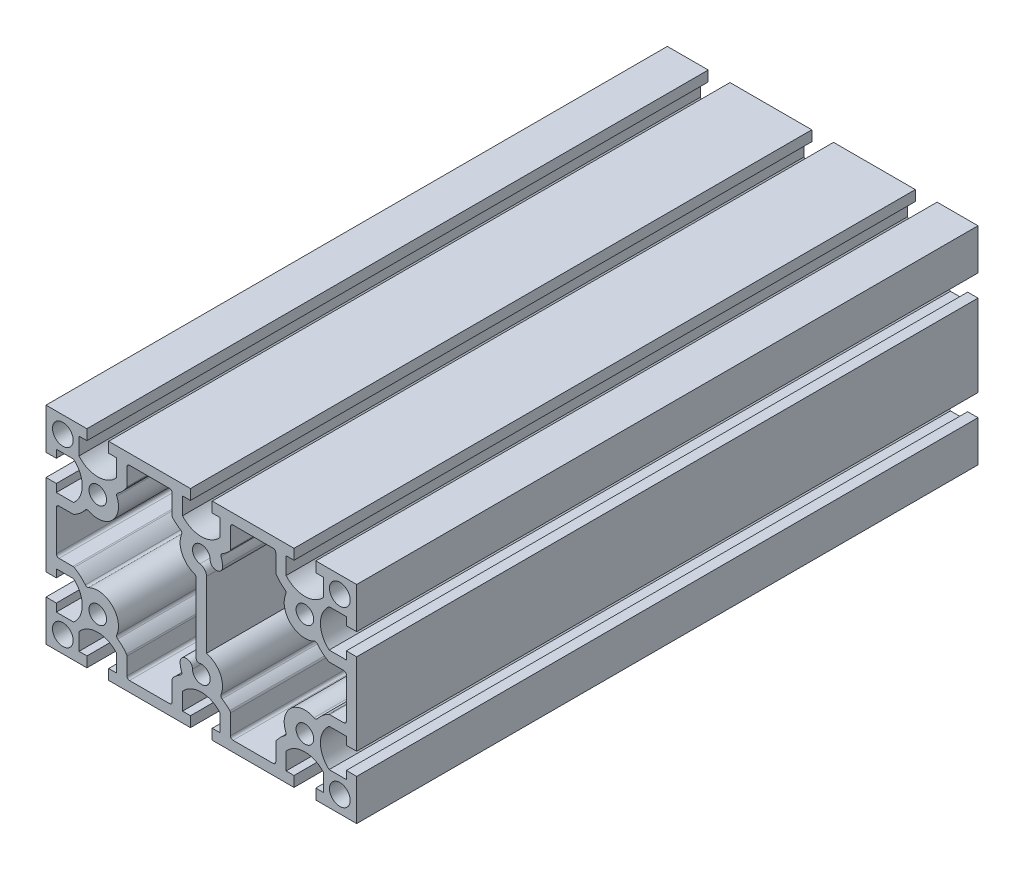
from build123d import *

# Parameters (mm, degrees)
EXTRUDE_1_DEPTH                 = 120
CUT_EXTRUDE_1_REACH             = 142
SKETCH_2_R                      = 4
SKETCH_2_R_2                    = 3.4
CUT_EXTRUDE_1_DIRECTION_2_REACH = 142
CUT_EXTRUDE_2_REACH             = 142
CUT_EXTRUDE_2_DIRECTION_2_REACH = 142


with BuildPart() as part:
    # Sketch 1 → Extrude 1 (new, symmetric)
    with BuildSketch(Plane.XY):
        with BuildLine():
            Line((4.2, 40), (35.8, 40))
            Line((35.8, 40), (35.8, 36))
            Line((35.8, 36), (32.75, 36))
            Line((32.75, 36), (32.75, 29.360985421))
            ThreePointArc((32.75, 29.360985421), (40, 26), (47.25, 29.360985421))
            Line((47.25, 29.360985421), (47.25, 36))
            Line((47.25, 36), (44.2, 36))
            Line((44.2, 36), (44.2, 40))
            Line((44.2, 40), (60, 40))
            Line((60, 40), (60, 24.2))
            Line((60, 24.2), (56, 24.2))
            Line((56, 24.2), (56, 27.25))
            Line((56, 27.25), (49.360985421, 27.25))
            ThreePointArc((49.360985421, 27.25), (46, 20), (49.360985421, 12.75))
            Line((49.360985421, 12.75), (56, 12.75))
            Line((56, 12.75), (56, 15.8))
            Line((56, 15.8), (60, 15.8))
            Line((60, 15.8), (60, -15.8))
            Line((60, -15.8), (56, -15.8))
            Line((56, -15.8), (56, -12.75))
            Line((56, -12.75), (49.360985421, -12.75))
            ThreePointArc((49.360985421, -12.75), (46, -20), (49.360985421, -27.25))
            Line((49.360985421, -27.25), (56, -27.25))
            Line((56, -27.25), (56, -24.2))
            Line((56, -24.2), (60, -24.2))
            Line((60, -24.2), (60, -40))
            Line((60, -40), (44.2, -40))
            Line((44.2, -40), (44.2, -36))
            Line((44.2, -36), (47.25, -36))
            Line((47.25, -36), (47.25, -29.360985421))
            ThreePointArc((47.25, -29.360985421), (40, -26), (32.75, -29.360985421))
            Line((32.75, -29.360985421), (32.75, -36))
            Line((32.75, -36), (35.8, -36))
            Line((35.8, -36), (35.8, -40))
            Line((35.8, -40), (4.2, -40))
            Line((4.2, -40), (4.2, -36))
            Line((4.2, -36), (7.25, -36))
            Line((7.25, -36), (7.25, -29.360985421))
            ThreePointArc((7.25, -29.360985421), (0, -26), (-7.25, -29.360985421))
            Line((-7.25, -29.360985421), (-7.25, -36))
            Line((-7.25, -36), (-4.2, -36))
            Line((-4.2, -36), (-4.2, -40))
            Line((-4.2, -40), (-35.8, -40))
            Line((-35.8, -40), (-35.8, -36))
            Line((-35.8, -36), (-32.75, -36))
            Line((-32.75, -36), (-32.75, -29.360985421))
            ThreePointArc((-32.75, -29.360985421), (-40, -26), (-47.25, -29.360985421))
            Line((-47.25, -29.360985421), (-47.25, -36))
            Line((-47.25, -36), (-44.2, -36))
            Line((-44.2, -36), (-44.2, -40))
            Line((-44.2, -40), (-60, -40))
            Line((-60, -40), (-60, -24.2))
            Line((-60, -24.2), (-56, -24.2))
            Line((-56, -24.2), (-56, -27.25))
            Line((-56, -27.25), (-49.360985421, -27.25))
            ThreePointArc((-49.360985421, -27.25), (-46, -20), (-49.360985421, -12.75))
            Line((-49.360985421, -12.75), (-56, -12.75))
            Line((-56, -12.75), (-56, -15.8))
            Line((-56, -15.8), (-60, -15.8))
            Line((-60, -15.8), (-60, 15.8))
            Line((-60, 15.8), (-56, 15.8))
            Line((-56, 15.8), (-56, 12.75))
            Line((-56, 12.75), (-49.360985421, 12.75))
            ThreePointArc((-49.360985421, 12.75), (-46, 20), (-49.360985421, 27.25))
            Line((-49.360985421, 27.25), (-56, 27.25))
            Line((-56, 27.25), (-56, 24.2))
            Line((-56, 24.2), (-60, 24.2))
            Line((-60, 24.2), (-60, 40))
            Line((-60, 40), (-44.2, 40))
            Line((-44.2, 40), (-44.2, 36))
            Line((-44.2, 36), (-47.25, 36))
            Line((-47.25, 36), (-47.25, 29.360985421))
            ThreePointArc((-47.25, 29.360985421), (-40, 26), (-32.75, 29.360985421))
            Line((-32.75, 29.360985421), (-32.75, 36))
            Line((-32.75, 36), (-35.8, 36))
            Line((-35.8, 36), (-35.8, 40))
            Line((-35.8, 40), (-4.2, 40))
            Line((-4.2, 40), (-4.2, 36))
            Line((-4.2, 36), (-7.25, 36))
            Line((-7.25, 36), (-7.25, 29.360985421))
            ThreePointArc((-7.25, 29.360985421), (0, 26), (7.25, 29.360985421))
            Line((7.25, 29.360985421), (7.25, 36))
            Line((7.25, 36), (4.2, 36))
            Line((4.2, 36), (4.2, 40))
        make_face()
    extrude(amount=EXTRUDE_1_DEPTH, both=True)

    # Sketch 2 → Cut-Extrude 1 (cut, up to next)
    with BuildSketch(Plane.XY, mode=Mode.PRIVATE) as cut_extrude_1_sk1:
        with Locations((53.5, 33.5)):
            Circle(SKETCH_2_R)
    cut_extrude_1_tool1 = extrude(cut_extrude_1_sk1.sketch, amount=-CUT_EXTRUDE_1_REACH, mode=Mode.PRIVATE) & part.part
    # Sketch 2 → Cut-Extrude 1 (cut, up to next)
    with BuildSketch(Plane.XY, mode=Mode.PRIVATE) as cut_extrude_1_sk2:
        with Locations((-53.5, 33.5)):
            Circle(SKETCH_2_R)
    cut_extrude_1_tool2 = extrude(cut_extrude_1_sk2.sketch, amount=-CUT_EXTRUDE_1_REACH, mode=Mode.PRIVATE) & part.part
    # Sketch 2 → Cut-Extrude 1 (cut, up to next)
    with BuildSketch(Plane.XY, mode=Mode.PRIVATE) as cut_extrude_1_sk3:
        with Locations((53.5, -33.5)):
            Circle(SKETCH_2_R)
    cut_extrude_1_tool3 = extrude(cut_extrude_1_sk3.sketch, amount=-CUT_EXTRUDE_1_REACH, mode=Mode.PRIVATE) & part.part
    # Sketch 2 → Cut-Extrude 1 (cut, up to next)
    with BuildSketch(Plane.XY, mode=Mode.PRIVATE) as cut_extrude_1_sk4:
        with Locations((-53.5, -33.5)):
            Circle(SKETCH_2_R)
    cut_extrude_1_tool4 = extrude(cut_extrude_1_sk4.sketch, amount=-CUT_EXTRUDE_1_REACH, mode=Mode.PRIVATE) & part.part
    # Sketch 2 → Cut-Extrude 1 (cut, up to next)
    with BuildSketch(Plane.XY, mode=Mode.PRIVATE) as cut_extrude_1_sk5:
        with Locations((40, 20)):
            Circle(SKETCH_2_R_2)
    cut_extrude_1_tool5 = extrude(cut_extrude_1_sk5.sketch, amount=-CUT_EXTRUDE_1_REACH, mode=Mode.PRIVATE) & part.part
    # Sketch 2 → Cut-Extrude 1 (cut, up to next)
    with BuildSketch(Plane.XY, mode=Mode.PRIVATE) as cut_extrude_1_sk6:
        with Locations((-40, 20)):
            Circle(SKETCH_2_R_2)
    cut_extrude_1_tool6 = extrude(cut_extrude_1_sk6.sketch, amount=-CUT_EXTRUDE_1_REACH, mode=Mode.PRIVATE) & part.part
    # Sketch 2 → Cut-Extrude 1 (cut, up to next)
    with BuildSketch(Plane.XY, mode=Mode.PRIVATE) as cut_extrude_1_sk7:
        with Locations((-40, -20)):
            Circle(SKETCH_2_R_2)
    cut_extrude_1_tool7 = extrude(cut_extrude_1_sk7.sketch, amount=-CUT_EXTRUDE_1_REACH, mode=Mode.PRIVATE) & part.part
    # Sketch 2 → Cut-Extrude 1 (cut, up to next)
    with BuildSketch(Plane.XY, mode=Mode.PRIVATE) as cut_extrude_1_sk8:
        with Locations((40, -20)):
            Circle(SKETCH_2_R_2)
    cut_extrude_1_tool8 = extrude(cut_extrude_1_sk8.sketch, amount=-CUT_EXTRUDE_1_REACH, mode=Mode.PRIVATE) & part.part
    # Sketch 2 → Cut-Extrude 1 (cut, up to next)
    with BuildSketch(Plane.XY, mode=Mode.PRIVATE) as cut_extrude_1_sk9:
        with Locations((0, 20)):
            Circle(SKETCH_2_R_2)
    cut_extrude_1_tool9 = extrude(cut_extrude_1_sk9.sketch, amount=-CUT_EXTRUDE_1_REACH, mode=Mode.PRIVATE) & part.part
    # Sketch 2 → Cut-Extrude 1 (cut, up to next)
    with BuildSketch(Plane.XY, mode=Mode.PRIVATE) as cut_extrude_1_sk10:
        with Locations((0, -20)):
            Circle(SKETCH_2_R_2)
    cut_extrude_1_tool10 = extrude(cut_extrude_1_sk10.sketch, amount=-CUT_EXTRUDE_1_REACH, mode=Mode.PRIVATE) & part.part
    add(cut_extrude_1_tool1.solids().sort_by_distance((53.5, 33.5, 0))[0], mode=Mode.SUBTRACT)
    add(cut_extrude_1_tool2.solids().sort_by_distance((-53.5, 33.5, 0))[0], mode=Mode.SUBTRACT)
    add(cut_extrude_1_tool3.solids().sort_by_distance((53.5, -33.5, 0))[0], mode=Mode.SUBTRACT)
    add(cut_extrude_1_tool4.solids().sort_by_distance((-53.5, -33.5, 0))[0], mode=Mode.SUBTRACT)
    add(cut_extrude_1_tool5.solids().sort_by_distance((40, 20, 0))[0], mode=Mode.SUBTRACT)
    add(cut_extrude_1_tool6.solids().sort_by_distance((-40, 20, 0))[0], mode=Mode.SUBTRACT)
    add(cut_extrude_1_tool7.solids().sort_by_distance((-40, -20, 0))[0], mode=Mode.SUBTRACT)
    add(cut_extrude_1_tool8.solids().sort_by_distance((40, -20, 0))[0], mode=Mode.SUBTRACT)
    add(cut_extrude_1_tool9.solids().sort_by_distance((0, 20, 0))[0], mode=Mode.SUBTRACT)
    add(cut_extrude_1_tool10.solids().sort_by_distance((0, -20, 0))[0], mode=Mode.SUBTRACT)

    # Sketch 2 → Cut-Extrude 1 direction 2 (cut, up to next)
    with BuildSketch(Plane.XY, mode=Mode.PRIVATE) as cut_extrude_1_direction_2_sk1:
        with Locations((53.5, 33.5)):
            Circle(SKETCH_2_R)
    cut_extrude_1_direction_2_tool1 = extrude(cut_extrude_1_direction_2_sk1.sketch, amount=CUT_EXTRUDE_1_DIRECTION_2_REACH, mode=Mode.PRIVATE) & part.part
    # Sketch 2 → Cut-Extrude 1 direction 2 (cut, up to next)
    with BuildSketch(Plane.XY, mode=Mode.PRIVATE) as cut_extrude_1_direction_2_sk2:
        with Locations((-53.5, 33.5)):
            Circle(SKETCH_2_R)
    cut_extrude_1_direction_2_tool2 = extrude(cut_extrude_1_direction_2_sk2.sketch, amount=CUT_EXTRUDE_1_DIRECTION_2_REACH, mode=Mode.PRIVATE) & part.part
    # Sketch 2 → Cut-Extrude 1 direction 2 (cut, up to next)
    with BuildSketch(Plane.XY, mode=Mode.PRIVATE) as cut_extrude_1_direction_2_sk3:
        with Locations((53.5, -33.5)):
            Circle(SKETCH_2_R)
    cut_extrude_1_direction_2_tool3 = extrude(cut_extrude_1_direction_2_sk3.sketch, amount=CUT_EXTRUDE_1_DIRECTION_2_REACH, mode=Mode.PRIVATE) & part.part
    # Sketch 2 → Cut-Extrude 1 direction 2 (cut, up to next)
    with BuildSketch(Plane.XY, mode=Mode.PRIVATE) as cut_extrude_1_direction_2_sk4:
        with Locations((-53.5, -33.5)):
            Circle(SKETCH_2_R)
    cut_extrude_1_direction_2_tool4 = extrude(cut_extrude_1_direction_2_sk4.sketch, amount=CUT_EXTRUDE_1_DIRECTION_2_REACH, mode=Mode.PRIVATE) & part.part
    # Sketch 2 → Cut-Extrude 1 direction 2 (cut, up to next)
    with BuildSketch(Plane.XY, mode=Mode.PRIVATE) as cut_extrude_1_direction_2_sk5:
        with Locations((40, 20)):
            Circle(SKETCH_2_R_2)
    cut_extrude_1_direction_2_tool5 = extrude(cut_extrude_1_direction_2_sk5.sketch, amount=CUT_EXTRUDE_1_DIRECTION_2_REACH, mode=Mode.PRIVATE) & part.part
    # Sketch 2 → Cut-Extrude 1 direction 2 (cut, up to next)
    with BuildSketch(Plane.XY, mode=Mode.PRIVATE) as cut_extrude_1_direction_2_sk6:
        with Locations((-40, 20)):
            Circle(SKETCH_2_R_2)
    cut_extrude_1_direction_2_tool6 = extrude(cut_extrude_1_direction_2_sk6.sketch, amount=CUT_EXTRUDE_1_DIRECTION_2_REACH, mode=Mode.PRIVATE) & part.part
    # Sketch 2 → Cut-Extrude 1 direction 2 (cut, up to next)
    with BuildSketch(Plane.XY, mode=Mode.PRIVATE) as cut_extrude_1_direction_2_sk7:
        with Locations((-40, -20)):
            Circle(SKETCH_2_R_2)
    cut_extrude_1_direction_2_tool7 = extrude(cut_extrude_1_direction_2_sk7.sketch, amount=CUT_EXTRUDE_1_DIRECTION_2_REACH, mode=Mode.PRIVATE) & part.part
    # Sketch 2 → Cut-Extrude 1 direction 2 (cut, up to next)
    with BuildSketch(Plane.XY, mode=Mode.PRIVATE) as cut_extrude_1_direction_2_sk8:
        with Locations((40, -20)):
            Circle(SKETCH_2_R_2)
    cut_extrude_1_direction_2_tool8 = extrude(cut_extrude_1_direction_2_sk8.sketch, amount=CUT_EXTRUDE_1_DIRECTION_2_REACH, mode=Mode.PRIVATE) & part.part
    # Sketch 2 → Cut-Extrude 1 direction 2 (cut, up to next)
    with BuildSketch(Plane.XY, mode=Mode.PRIVATE) as cut_extrude_1_direction_2_sk9:
        with Locations((0, 20)):
            Circle(SKETCH_2_R_2)
    cut_extrude_1_direction_2_tool9 = extrude(cut_extrude_1_direction_2_sk9.sketch, amount=CUT_EXTRUDE_1_DIRECTION_2_REACH, mode=Mode.PRIVATE) & part.part
    # Sketch 2 → Cut-Extrude 1 direction 2 (cut, up to next)
    with BuildSketch(Plane.XY, mode=Mode.PRIVATE) as cut_extrude_1_direction_2_sk10:
        with Locations((0, -20)):
            Circle(SKETCH_2_R_2)
    cut_extrude_1_direction_2_tool10 = extrude(cut_extrude_1_direction_2_sk10.sketch, amount=CUT_EXTRUDE_1_DIRECTION_2_REACH, mode=Mode.PRIVATE) & part.part
    add(cut_extrude_1_direction_2_tool1.solids().sort_by_distance((53.5, 33.5, 0))[0], mode=Mode.SUBTRACT)
    add(cut_extrude_1_direction_2_tool2.solids().sort_by_distance((-53.5, 33.5, 0))[0], mode=Mode.SUBTRACT)
    add(cut_extrude_1_direction_2_tool3.solids().sort_by_distance((53.5, -33.5, 0))[0], mode=Mode.SUBTRACT)
    add(cut_extrude_1_direction_2_tool4.solids().sort_by_distance((-53.5, -33.5, 0))[0], mode=Mode.SUBTRACT)
    add(cut_extrude_1_direction_2_tool5.solids().sort_by_distance((40, 20, 0))[0], mode=Mode.SUBTRACT)
    add(cut_extrude_1_direction_2_tool6.solids().sort_by_distance((-40, 20, 0))[0], mode=Mode.SUBTRACT)
    add(cut_extrude_1_direction_2_tool7.solids().sort_by_distance((-40, -20, 0))[0], mode=Mode.SUBTRACT)
    add(cut_extrude_1_direction_2_tool8.solids().sort_by_distance((40, -20, 0))[0], mode=Mode.SUBTRACT)
    add(cut_extrude_1_direction_2_tool9.solids().sort_by_distance((0, 20, 0))[0], mode=Mode.SUBTRACT)
    add(cut_extrude_1_direction_2_tool10.solids().sort_by_distance((0, -20, 0))[0], mode=Mode.SUBTRACT)

    # Sketch 3 → Cut-Extrude 2 (cut, up to next)
    with BuildSketch(Plane.XY, mode=Mode.PRIVATE) as cut_extrude_2_sk1:
        with BuildLine():
            Line((2, -12.047641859), (2, 13.678607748))
            ThreePointArc((2, 13.678607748), (1.281035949, 15.627164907), (-0.53125, 16.641760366))
            ThreePointArc((-0.53125, 16.641760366), (-2.20836478, 22.585174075), (3.4, 20))
            ThreePointArc((3.4, 20), (5.8, 17.6), (8.2, 20))
            ThreePointArc((8.2, 20), (8.05080508, 21.557092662), (7.608649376, 23.057524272))
            ThreePointArc((7.608649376, 23.057524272), (7.588720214, 23.749219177), (8.022641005, 24.288247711))
            ThreePointArc((8.022641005, 24.288247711), (9.58807252, 25.383612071), (10.983192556, 26.689000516))
            ThreePointArc((10.983192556, 26.689000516), (11.180911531, 27.003776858), (11.25, 27.369021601))
            Line((11.25, 27.369021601), (11.25, 35))
            ThreePointArc((11.25, 35), (11.542893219, 35.707106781), (12.25, 36))
            Line((12.25, 36), (27.75, 36))
            ThreePointArc((27.75, 36), (28.457106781, 35.707106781), (28.75, 35))
            Line((28.75, 35), (28.75, 28.345455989))
            ThreePointArc((28.75, 28.345455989), (28.796060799, 28.045455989), (28.93, 27.773092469))
            ThreePointArc((28.93, 27.773092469), (30.470998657, 25.93714826), (32.312395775, 24.402669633))
            ThreePointArc((32.312395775, 24.402669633), (32.70457927, 23.854974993), (32.66039432, 23.182795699))
            ThreePointArc((32.66039432, 23.182795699), (34.491304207, 14.198769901), (43.557967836, 12.834746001))
            ThreePointArc((43.557967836, 12.834746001), (44.228105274, 12.913357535), (44.795630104, 12.548419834))
            ThreePointArc((44.795630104, 12.548419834), (46.770106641, 10.476860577), (49.136885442, 8.868049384))
            ThreePointArc((49.136885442, 8.868049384), (49.365277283, 8.779961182), (49.608227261, 8.75))
            Line((49.608227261, 8.75), (55, 8.75))
            ThreePointArc((55, 8.75), (55.707106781, 8.457106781), (56, 7.75))
            Line((56, 7.75), (56, -7.75))
            ThreePointArc((56, -7.75), (55.707106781, -8.457106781), (55, -8.75))
            Line((55, -8.75), (49.608227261, -8.75))
            ThreePointArc((49.608227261, -8.75), (49.365277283, -8.779961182), (49.136885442, -8.868049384))
            ThreePointArc((49.136885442, -8.868049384), (46.770106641, -10.476860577), (44.795630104, -12.548419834))
            ThreePointArc((44.795630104, -12.548419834), (44.228105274, -12.913357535), (43.557967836, -12.834746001))
            ThreePointArc((43.557967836, -12.834746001), (34.491304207, -14.198769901), (32.66039432, -23.182795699))
            ThreePointArc((32.66039432, -23.182795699), (32.70457927, -23.854974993), (32.312395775, -24.402669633))
            ThreePointArc((32.312395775, -24.402669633), (30.470998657, -25.93714826), (28.93, -27.773092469))
            ThreePointArc((28.93, -27.773092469), (28.796060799, -28.045455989), (28.75, -28.345455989))
            Line((28.75, -28.345455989), (28.75, -35))
            ThreePointArc((28.75, -35), (28.457106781, -35.707106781), (27.75, -36))
            Line((27.75, -36), (12.25, -36))
            ThreePointArc((12.25, -36), (11.542893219, -35.707106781), (11.25, -35))
            Line((11.25, -35), (11.25, -27.369021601))
            ThreePointArc((11.25, -27.369021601), (11.180911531, -27.003776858), (10.983192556, -26.689000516))
            ThreePointArc((10.983192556, -26.689000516), (9.58807252, -25.383612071), (8.022641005, -24.288247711))
            ThreePointArc((8.022641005, -24.288247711), (7.588720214, -23.749219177), (7.608649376, -23.057524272))
            ThreePointArc((7.608649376, -23.057524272), (7.306566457, -16.277892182), (2, -12.047641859))
        make_face()
    cut_extrude_2_tool1 = extrude(cut_extrude_2_sk1.sketch, amount=-CUT_EXTRUDE_2_REACH, mode=Mode.PRIVATE) & part.part
    # Sketch 3 → Cut-Extrude 2 (cut, up to next)
    with BuildSketch(Plane.XY, mode=Mode.PRIVATE) as cut_extrude_2_sk2:
        with BuildLine():
            Line((-2, -15.715142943), (-2, 11.302874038))
            ThreePointArc((-2, 11.302874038), (-2.185725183, 11.8833536), (-2.673913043, 12.248213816))
            ThreePointArc((-2.673913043, 12.248213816), (-7.459428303, 16.594573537), (-7.608649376, 23.057524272))
            ThreePointArc((-7.608649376, 23.057524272), (-7.588720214, 23.749219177), (-8.022641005, 24.288247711))
            ThreePointArc((-8.022641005, 24.288247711), (-9.58807252, 25.383612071), (-10.983192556, 26.689000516))
            ThreePointArc((-10.983192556, 26.689000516), (-11.180911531, 27.003776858), (-11.25, 27.369021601))
            Line((-11.25, 27.369021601), (-11.25, 35))
            ThreePointArc((-11.25, 35), (-11.542893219, 35.707106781), (-12.25, 36))
            Line((-12.25, 36), (-27.75, 36))
            ThreePointArc((-27.75, 36), (-28.457106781, 35.707106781), (-28.75, 35))
            Line((-28.75, 35), (-28.75, 28.345455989))
            ThreePointArc((-28.75, 28.345455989), (-28.796060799, 28.045455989), (-28.93, 27.773092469))
            ThreePointArc((-28.93, 27.773092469), (-30.470998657, 25.93714826), (-32.312395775, 24.402669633))
            ThreePointArc((-32.312395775, 24.402669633), (-32.70457927, 23.854974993), (-32.66039432, 23.182795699))
            ThreePointArc((-32.66039432, 23.182795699), (-34.491304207, 14.198769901), (-43.557967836, 12.834746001))
            ThreePointArc((-43.557967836, 12.834746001), (-44.228105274, 12.913357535), (-44.795630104, 12.548419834))
            ThreePointArc((-44.795630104, 12.548419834), (-46.770106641, 10.476860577), (-49.136885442, 8.868049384))
            ThreePointArc((-49.136885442, 8.868049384), (-49.365277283, 8.779961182), (-49.608227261, 8.75))
            Line((-49.608227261, 8.75), (-55, 8.75))
            ThreePointArc((-55, 8.75), (-55.707106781, 8.457106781), (-56, 7.75))
            Line((-56, 7.75), (-56, -7.75))
            ThreePointArc((-56, -7.75), (-55.707106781, -8.457106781), (-55, -8.75))
            Line((-55, -8.75), (-49.608227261, -8.75))
            ThreePointArc((-49.608227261, -8.75), (-49.365277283, -8.779961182), (-49.136885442, -8.868049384))
            ThreePointArc((-49.136885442, -8.868049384), (-46.770106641, -10.476860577), (-44.795630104, -12.548419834))
            ThreePointArc((-44.795630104, -12.548419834), (-44.228105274, -12.913357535), (-43.557967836, -12.834746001))
            ThreePointArc((-43.557967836, -12.834746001), (-34.491304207, -14.198769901), (-32.66039432, -23.182795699))
            ThreePointArc((-32.66039432, -23.182795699), (-32.70457927, -23.854974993), (-32.312395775, -24.402669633))
            ThreePointArc((-32.312395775, -24.402669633), (-30.470998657, -25.93714826), (-28.93, -27.773092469))
            ThreePointArc((-28.93, -27.773092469), (-28.796060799, -28.045455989), (-28.75, -28.345455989))
            Line((-28.75, -28.345455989), (-28.75, -35))
            ThreePointArc((-28.75, -35), (-28.457106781, -35.707106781), (-27.75, -36))
            Line((-27.75, -36), (-12.25, -36))
            ThreePointArc((-12.25, -36), (-11.542893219, -35.707106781), (-11.25, -35))
            Line((-11.25, -35), (-11.25, -27.369021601))
            ThreePointArc((-11.25, -27.369021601), (-11.180911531, -27.003776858), (-10.983192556, -26.689000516))
            ThreePointArc((-10.983192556, -26.689000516), (-9.58807252, -25.383612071), (-8.022641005, -24.288247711))
            ThreePointArc((-8.022641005, -24.288247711), (-7.588720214, -23.749219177), (-7.608649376, -23.057524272))
            ThreePointArc((-7.608649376, -23.057524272), (-8.05080508, -21.557092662), (-8.2, -20))
            ThreePointArc((-8.2, -20), (-5.8, -17.6), (-3.4, -20))
            ThreePointArc((-3.4, -20), (2.663388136, -22.113377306), (-0.772727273, -16.688974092))
            ThreePointArc((-0.772727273, -16.688974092), (-1.621581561, -16.498492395), (-2, -15.715142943))
        make_face()
    cut_extrude_2_tool2 = extrude(cut_extrude_2_sk2.sketch, amount=-CUT_EXTRUDE_2_REACH, mode=Mode.PRIVATE) & part.part
    add(cut_extrude_2_tool1.solids().sort_by_distance((23.741529, 0.484413, 0))[0], mode=Mode.SUBTRACT)
    add(cut_extrude_2_tool2.solids().sort_by_distance((-23.758301, -0.474004, 0))[0], mode=Mode.SUBTRACT)

    # Sketch 3 → Cut-Extrude 2 direction 2 (cut, up to next)
    with BuildSketch(Plane.XY, mode=Mode.PRIVATE) as cut_extrude_2_direction_2_sk1:
        with BuildLine():
            Line((2, -12.047641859), (2, 13.678607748))
            ThreePointArc((2, 13.678607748), (1.281035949, 15.627164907), (-0.53125, 16.641760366))
            ThreePointArc((-0.53125, 16.641760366), (-2.20836478, 22.585174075), (3.4, 20))
            ThreePointArc((3.4, 20), (5.8, 17.6), (8.2, 20))
            ThreePointArc((8.2, 20), (8.05080508, 21.557092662), (7.608649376, 23.057524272))
            ThreePointArc((7.608649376, 23.057524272), (7.588720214, 23.749219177), (8.022641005, 24.288247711))
            ThreePointArc((8.022641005, 24.288247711), (9.58807252, 25.383612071), (10.983192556, 26.689000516))
            ThreePointArc((10.983192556, 26.689000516), (11.180911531, 27.003776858), (11.25, 27.369021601))
            Line((11.25, 27.369021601), (11.25, 35))
            ThreePointArc((11.25, 35), (11.542893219, 35.707106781), (12.25, 36))
            Line((12.25, 36), (27.75, 36))
            ThreePointArc((27.75, 36), (28.457106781, 35.707106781), (28.75, 35))
            Line((28.75, 35), (28.75, 28.345455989))
            ThreePointArc((28.75, 28.345455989), (28.796060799, 28.045455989), (28.93, 27.773092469))
            ThreePointArc((28.93, 27.773092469), (30.470998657, 25.93714826), (32.312395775, 24.402669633))
            ThreePointArc((32.312395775, 24.402669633), (32.70457927, 23.854974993), (32.66039432, 23.182795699))
            ThreePointArc((32.66039432, 23.182795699), (34.491304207, 14.198769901), (43.557967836, 12.834746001))
            ThreePointArc((43.557967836, 12.834746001), (44.228105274, 12.913357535), (44.795630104, 12.548419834))
            ThreePointArc((44.795630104, 12.548419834), (46.770106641, 10.476860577), (49.136885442, 8.868049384))
            ThreePointArc((49.136885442, 8.868049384), (49.365277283, 8.779961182), (49.608227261, 8.75))
            Line((49.608227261, 8.75), (55, 8.75))
            ThreePointArc((55, 8.75), (55.707106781, 8.457106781), (56, 7.75))
            Line((56, 7.75), (56, -7.75))
            ThreePointArc((56, -7.75), (55.707106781, -8.457106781), (55, -8.75))
            Line((55, -8.75), (49.608227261, -8.75))
            ThreePointArc((49.608227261, -8.75), (49.365277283, -8.779961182), (49.136885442, -8.868049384))
            ThreePointArc((49.136885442, -8.868049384), (46.770106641, -10.476860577), (44.795630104, -12.548419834))
            ThreePointArc((44.795630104, -12.548419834), (44.228105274, -12.913357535), (43.557967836, -12.834746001))
            ThreePointArc((43.557967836, -12.834746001), (34.491304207, -14.198769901), (32.66039432, -23.182795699))
            ThreePointArc((32.66039432, -23.182795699), (32.70457927, -23.854974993), (32.312395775, -24.402669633))
            ThreePointArc((32.312395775, -24.402669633), (30.470998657, -25.93714826), (28.93, -27.773092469))
            ThreePointArc((28.93, -27.773092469), (28.796060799, -28.045455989), (28.75, -28.345455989))
            Line((28.75, -28.345455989), (28.75, -35))
            ThreePointArc((28.75, -35), (28.457106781, -35.707106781), (27.75, -36))
            Line((27.75, -36), (12.25, -36))
            ThreePointArc((12.25, -36), (11.542893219, -35.707106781), (11.25, -35))
            Line((11.25, -35), (11.25, -27.369021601))
            ThreePointArc((11.25, -27.369021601), (11.180911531, -27.003776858), (10.983192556, -26.689000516))
            ThreePointArc((10.983192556, -26.689000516), (9.58807252, -25.383612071), (8.022641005, -24.288247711))
            ThreePointArc((8.022641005, -24.288247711), (7.588720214, -23.749219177), (7.608649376, -23.057524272))
            ThreePointArc((7.608649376, -23.057524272), (7.306566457, -16.277892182), (2, -12.047641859))
        make_face()
    cut_extrude_2_direction_2_tool1 = extrude(cut_extrude_2_direction_2_sk1.sketch, amount=CUT_EXTRUDE_2_DIRECTION_2_REACH, mode=Mode.PRIVATE) & part.part
    # Sketch 3 → Cut-Extrude 2 direction 2 (cut, up to next)
    with BuildSketch(Plane.XY, mode=Mode.PRIVATE) as cut_extrude_2_direction_2_sk2:
        with BuildLine():
            Line((-2, -15.715142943), (-2, 11.302874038))
            ThreePointArc((-2, 11.302874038), (-2.185725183, 11.8833536), (-2.673913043, 12.248213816))
            ThreePointArc((-2.673913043, 12.248213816), (-7.459428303, 16.594573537), (-7.608649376, 23.057524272))
            ThreePointArc((-7.608649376, 23.057524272), (-7.588720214, 23.749219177), (-8.022641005, 24.288247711))
            ThreePointArc((-8.022641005, 24.288247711), (-9.58807252, 25.383612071), (-10.983192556, 26.689000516))
            ThreePointArc((-10.983192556, 26.689000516), (-11.180911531, 27.003776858), (-11.25, 27.369021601))
            Line((-11.25, 27.369021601), (-11.25, 35))
            ThreePointArc((-11.25, 35), (-11.542893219, 35.707106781), (-12.25, 36))
            Line((-12.25, 36), (-27.75, 36))
            ThreePointArc((-27.75, 36), (-28.457106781, 35.707106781), (-28.75, 35))
            Line((-28.75, 35), (-28.75, 28.345455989))
            ThreePointArc((-28.75, 28.345455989), (-28.796060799, 28.045455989), (-28.93, 27.773092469))
            ThreePointArc((-28.93, 27.773092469), (-30.470998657, 25.93714826), (-32.312395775, 24.402669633))
            ThreePointArc((-32.312395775, 24.402669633), (-32.70457927, 23.854974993), (-32.66039432, 23.182795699))
            ThreePointArc((-32.66039432, 23.182795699), (-34.491304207, 14.198769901), (-43.557967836, 12.834746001))
            ThreePointArc((-43.557967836, 12.834746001), (-44.228105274, 12.913357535), (-44.795630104, 12.548419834))
            ThreePointArc((-44.795630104, 12.548419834), (-46.770106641, 10.476860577), (-49.136885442, 8.868049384))
            ThreePointArc((-49.136885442, 8.868049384), (-49.365277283, 8.779961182), (-49.608227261, 8.75))
            Line((-49.608227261, 8.75), (-55, 8.75))
            ThreePointArc((-55, 8.75), (-55.707106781, 8.457106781), (-56, 7.75))
            Line((-56, 7.75), (-56, -7.75))
            ThreePointArc((-56, -7.75), (-55.707106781, -8.457106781), (-55, -8.75))
            Line((-55, -8.75), (-49.608227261, -8.75))
            ThreePointArc((-49.608227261, -8.75), (-49.365277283, -8.779961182), (-49.136885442, -8.868049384))
            ThreePointArc((-49.136885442, -8.868049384), (-46.770106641, -10.476860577), (-44.795630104, -12.548419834))
            ThreePointArc((-44.795630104, -12.548419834), (-44.228105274, -12.913357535), (-43.557967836, -12.834746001))
            ThreePointArc((-43.557967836, -12.834746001), (-34.491304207, -14.198769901), (-32.66039432, -23.182795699))
            ThreePointArc((-32.66039432, -23.182795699), (-32.70457927, -23.854974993), (-32.312395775, -24.402669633))
            ThreePointArc((-32.312395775, -24.402669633), (-30.470998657, -25.93714826), (-28.93, -27.773092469))
            ThreePointArc((-28.93, -27.773092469), (-28.796060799, -28.045455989), (-28.75, -28.345455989))
            Line((-28.75, -28.345455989), (-28.75, -35))
            ThreePointArc((-28.75, -35), (-28.457106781, -35.707106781), (-27.75, -36))
            Line((-27.75, -36), (-12.25, -36))
            ThreePointArc((-12.25, -36), (-11.542893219, -35.707106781), (-11.25, -35))
            Line((-11.25, -35), (-11.25, -27.369021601))
            ThreePointArc((-11.25, -27.369021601), (-11.180911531, -27.003776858), (-10.983192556, -26.689000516))
            ThreePointArc((-10.983192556, -26.689000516), (-9.58807252, -25.383612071), (-8.022641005, -24.288247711))
            ThreePointArc((-8.022641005, -24.288247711), (-7.588720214, -23.749219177), (-7.608649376, -23.057524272))
            ThreePointArc((-7.608649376, -23.057524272), (-8.05080508, -21.557092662), (-8.2, -20))
            ThreePointArc((-8.2, -20), (-5.8, -17.6), (-3.4, -20))
            ThreePointArc((-3.4, -20), (2.663388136, -22.113377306), (-0.772727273, -16.688974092))
            ThreePointArc((-0.772727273, -16.688974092), (-1.621581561, -16.498492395), (-2, -15.715142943))
        make_face()
    cut_extrude_2_direction_2_tool2 = extrude(cut_extrude_2_direction_2_sk2.sketch, amount=CUT_EXTRUDE_2_DIRECTION_2_REACH, mode=Mode.PRIVATE) & part.part
    add(cut_extrude_2_direction_2_tool1.solids().sort_by_distance((23.741529, 0.484413, 0))[0], mode=Mode.SUBTRACT)
    add(cut_extrude_2_direction_2_tool2.solids().sort_by_distance((-23.758301, -0.474004, 0))[0], mode=Mode.SUBTRACT)


solid = part.part
